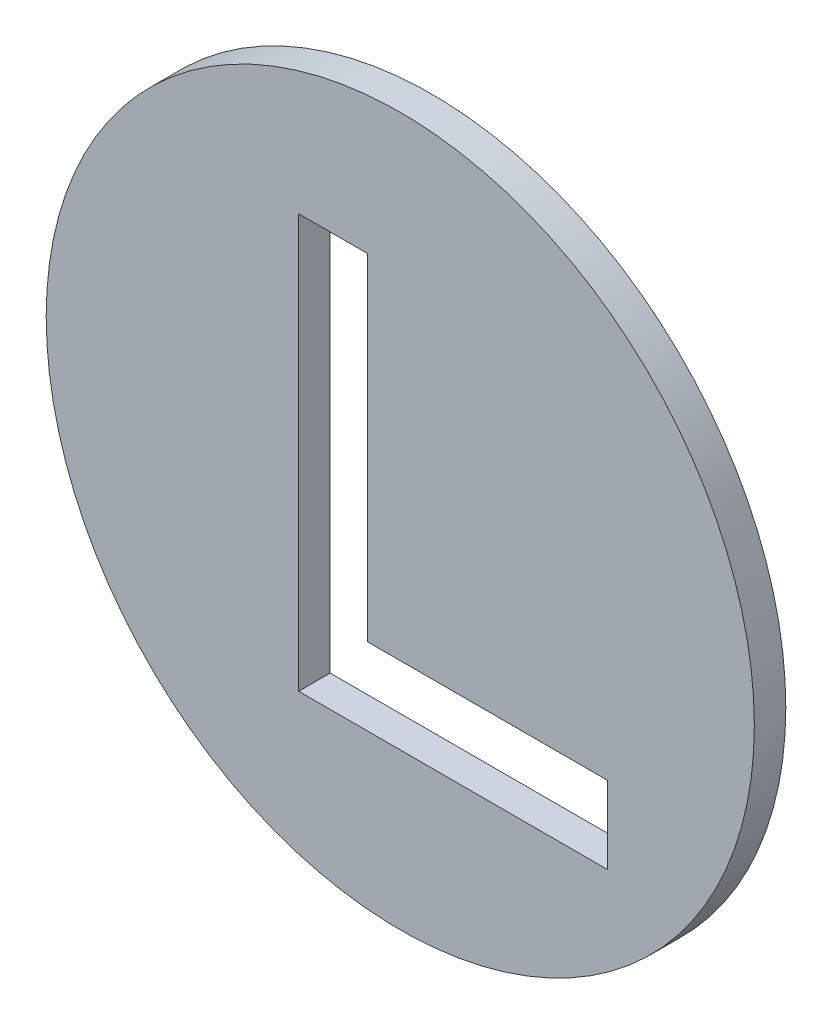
from build123d import *

# Parameters (mm, degrees)
SKETCH1_R           = 45
BOSS_EXTRUDE1_DEPTH = 4
CUT_EXTRUDE1_DEPTH  = 4


with BuildPart() as part:
    # Sketch1 → Boss-Extrude1 (new body)
    with BuildSketch(Plane.XY):
        Circle(SKETCH1_R)
    extrude(amount=BOSS_EXTRUDE1_DEPTH)

    # Sketch2 → Cut-Extrude1 (cut)
    with BuildSketch(Plane.XY.offset(4)):
        Polygon((-12.910933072, 27.367541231), (-12.910933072, -25.185411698), (26.367398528, -25.185411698), (26.367398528, -15.365828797), (-4.182414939, -15.365828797), (-4.182414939, 27.367541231), align=None)
    extrude(amount=-CUT_EXTRUDE1_DEPTH, mode=Mode.SUBTRACT)


solid = part.part
